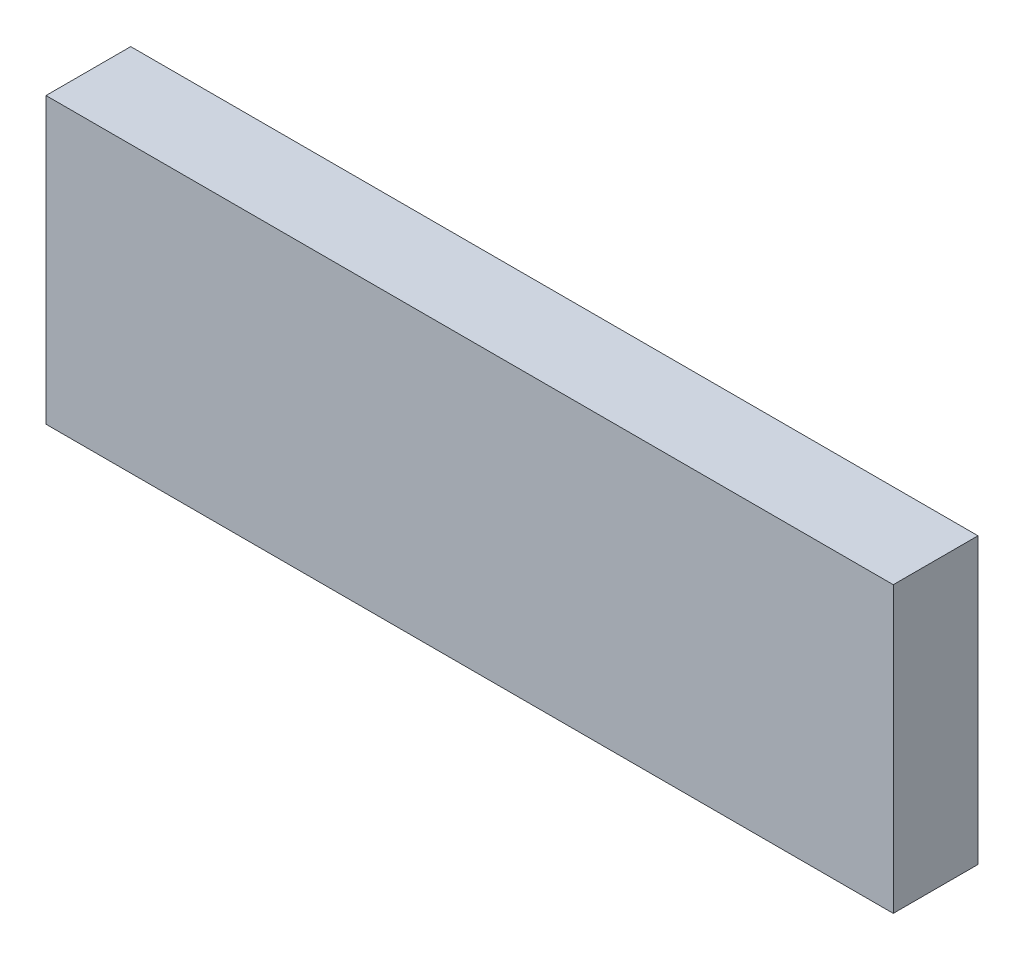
ISO-10303-21;
HEADER;
FILE_DESCRIPTION(('STEP AP214'),'2;1');
FILE_NAME('part.step','',(''),(''),'','','');
FILE_SCHEMA(('AUTOMOTIVE_DESIGN { 1 0 10303 214 1 1 1 1 }'));
ENDSEC;
DATA;
#1=APPLICATION_CONTEXT('core data for automotive mechanical design processes');
#2=APPLICATION_PROTOCOL_DEFINITION('international standard','automotive_design',2000,#1);
#3=PRODUCT_CONTEXT('',#1,'mechanical');
#4=PRODUCT('Part','Part','',(#3));
#5=PRODUCT_RELATED_PRODUCT_CATEGORY('part','',(#4));
#6=PRODUCT_DEFINITION_FORMATION('','',#4);
#7=PRODUCT_DEFINITION_CONTEXT('part definition',#1,'design');
#8=PRODUCT_DEFINITION('design','',#6,#7);
#9=PRODUCT_DEFINITION_SHAPE('','',#8);
#10=(LENGTH_UNIT() NAMED_UNIT(*) SI_UNIT(.MILLI.,.METRE.));
#11=(NAMED_UNIT(*) PLANE_ANGLE_UNIT() SI_UNIT($,.RADIAN.));
#12=(NAMED_UNIT(*) SI_UNIT($,.STERADIAN.) SOLID_ANGLE_UNIT());
#13=UNCERTAINTY_MEASURE_WITH_UNIT(LENGTH_MEASURE(1.E-05),#10,'distance_accuracy_value','');
#14=(GEOMETRIC_REPRESENTATION_CONTEXT(3) GLOBAL_UNCERTAINTY_ASSIGNED_CONTEXT((#13)) GLOBAL_UNIT_ASSIGNED_CONTEXT((#10,
#11,#12)) REPRESENTATION_CONTEXT('',''));
#15=CARTESIAN_POINT('',(0.,0.,0.));
#16=DIRECTION('',(0.,0.,1.));
#17=DIRECTION('',(1.,0.,0.));
#18=AXIS2_PLACEMENT_3D('',#15,#16,#17);
#19=CARTESIAN_POINT('',(0.,0.,3.175));
#20=DIRECTION('',(1.,0.,0.));
#21=DIRECTION('',(0.,0.,-1.));
#22=AXIS2_PLACEMENT_3D('',#19,#20,#21);
#23=PLANE('',#22);
#24=DIRECTION('',(0.,-1.,0.));
#25=VECTOR('',#24,1.);
#26=CARTESIAN_POINT('',(0.,0.,0.));
#27=LINE('',#26,#25);
#28=CARTESIAN_POINT('',(0.,10.668,0.));
#29=VERTEX_POINT('',#28);
#30=CARTESIAN_POINT('',(0.,0.,0.));
#31=VERTEX_POINT('',#30);
#32=EDGE_CURVE('E75',#29,#31,#27,.T.);
#33=ORIENTED_EDGE('',*,*,#32,.T.);
#34=DIRECTION('',(0.,0.,-1.));
#35=VECTOR('',#34,1.);
#36=CARTESIAN_POINT('',(0.,0.,3.175));
#37=LINE('',#36,#35);
#38=CARTESIAN_POINT('',(0.,0.,3.175));
#39=VERTEX_POINT('',#38);
#40=EDGE_CURVE('E11',#39,#31,#37,.T.);
#41=ORIENTED_EDGE('',*,*,#40,.F.);
#42=DIRECTION('',(0.,-1.,0.));
#43=VECTOR('',#42,1.);
#44=CARTESIAN_POINT('',(0.,0.,3.175));
#45=LINE('',#44,#43);
#46=CARTESIAN_POINT('',(0.,10.668,3.175));
#47=VERTEX_POINT('',#46);
#48=EDGE_CURVE('E93',#47,#39,#45,.T.);
#49=ORIENTED_EDGE('',*,*,#48,.F.);
#50=DIRECTION('',(0.,0.,-1.));
#51=VECTOR('',#50,1.);
#52=CARTESIAN_POINT('',(0.,10.668,3.175));
#53=LINE('',#52,#51);
#54=EDGE_CURVE('E87',#47,#29,#53,.T.);
#55=ORIENTED_EDGE('',*,*,#54,.T.);
#56=EDGE_LOOP('',(#33,#41,#49,#55));
#57=FACE_BOUND('',#56,.T.);
#58=ADVANCED_FACE('F31',(#57),#23,.F.);
#59=CARTESIAN_POINT('',(0.,0.,3.175));
#60=DIRECTION('',(0.,1.,0.));
#61=DIRECTION('',(0.,0.,1.));
#62=AXIS2_PLACEMENT_3D('',#59,#60,#61);
#63=PLANE('',#62);
#64=DIRECTION('',(1.,0.,0.));
#65=VECTOR('',#64,1.);
#66=CARTESIAN_POINT('',(0.,0.,0.));
#67=LINE('',#66,#65);
#68=CARTESIAN_POINT('',(31.75,0.,0.));
#69=VERTEX_POINT('',#68);
#70=EDGE_CURVE('E71',#31,#69,#67,.T.);
#71=ORIENTED_EDGE('',*,*,#70,.T.);
#72=DIRECTION('',(0.,0.,-1.));
#73=VECTOR('',#72,1.);
#74=CARTESIAN_POINT('',(31.75,0.,3.175));
#75=LINE('',#74,#73);
#76=CARTESIAN_POINT('',(31.75,0.,3.175));
#77=VERTEX_POINT('',#76);
#78=EDGE_CURVE('E38',#77,#69,#75,.T.);
#79=ORIENTED_EDGE('',*,*,#78,.F.);
#80=DIRECTION('',(1.,0.,0.));
#81=VECTOR('',#80,1.);
#82=CARTESIAN_POINT('',(0.,0.,3.175));
#83=LINE('',#82,#81);
#84=EDGE_CURVE('E83',#39,#77,#83,.T.);
#85=ORIENTED_EDGE('',*,*,#84,.F.);
#86=ORIENTED_EDGE('',*,*,#40,.T.);
#87=EDGE_LOOP('',(#71,#79,#85,#86));
#88=FACE_BOUND('',#87,.T.);
#89=ADVANCED_FACE('F82',(#88),#63,.F.);
#90=CARTESIAN_POINT('',(31.75,0.,3.175));
#91=DIRECTION('',(-1.,0.,0.));
#92=DIRECTION('',(0.,0.,1.));
#93=AXIS2_PLACEMENT_3D('',#90,#91,#92);
#94=PLANE('',#93);
#95=DIRECTION('',(0.,1.,0.));
#96=VECTOR('',#95,1.);
#97=CARTESIAN_POINT('',(31.75,0.,0.));
#98=LINE('',#97,#96);
#99=CARTESIAN_POINT('',(31.75,10.668,0.));
#100=VERTEX_POINT('',#99);
#101=EDGE_CURVE('E76',#69,#100,#98,.T.);
#102=ORIENTED_EDGE('',*,*,#101,.T.);
#103=DIRECTION('',(0.,0.,-1.));
#104=VECTOR('',#103,1.);
#105=CARTESIAN_POINT('',(31.75,10.668,3.175));
#106=LINE('',#105,#104);
#107=CARTESIAN_POINT('',(31.75,10.668,3.175));
#108=VERTEX_POINT('',#107);
#109=EDGE_CURVE('E99',#108,#100,#106,.T.);
#110=ORIENTED_EDGE('',*,*,#109,.F.);
#111=DIRECTION('',(0.,1.,0.));
#112=VECTOR('',#111,1.);
#113=CARTESIAN_POINT('',(31.75,0.,3.175));
#114=LINE('',#113,#112);
#115=EDGE_CURVE('E50',#77,#108,#114,.T.);
#116=ORIENTED_EDGE('',*,*,#115,.F.);
#117=ORIENTED_EDGE('',*,*,#78,.T.);
#118=EDGE_LOOP('',(#102,#110,#116,#117));
#119=FACE_BOUND('',#118,.T.);
#120=ADVANCED_FACE('F102',(#119),#94,.F.);
#121=CARTESIAN_POINT('',(0.,10.668,3.175));
#122=DIRECTION('',(0.,-1.,0.));
#123=DIRECTION('',(0.,0.,-1.));
#124=AXIS2_PLACEMENT_3D('',#121,#122,#123);
#125=PLANE('',#124);
#126=DIRECTION('',(-1.,0.,0.));
#127=VECTOR('',#126,1.);
#128=CARTESIAN_POINT('',(0.,10.668,0.));
#129=LINE('',#128,#127);
#130=EDGE_CURVE('E91',#100,#29,#129,.T.);
#131=ORIENTED_EDGE('',*,*,#130,.T.);
#132=ORIENTED_EDGE('',*,*,#54,.F.);
#133=DIRECTION('',(-1.,0.,0.));
#134=VECTOR('',#133,1.);
#135=CARTESIAN_POINT('',(0.,10.668,3.175));
#136=LINE('',#135,#134);
#137=EDGE_CURVE('E45',#108,#47,#136,.T.);
#138=ORIENTED_EDGE('',*,*,#137,.F.);
#139=ORIENTED_EDGE('',*,*,#109,.T.);
#140=EDGE_LOOP('',(#131,#132,#138,#139));
#141=FACE_BOUND('',#140,.T.);
#142=ADVANCED_FACE('F104',(#141),#125,.F.);
#143=CARTESIAN_POINT('',(0.,10.668,3.175));
#144=DIRECTION('',(0.,0.,-1.));
#145=DIRECTION('',(-1.,0.,0.));
#146=AXIS2_PLACEMENT_3D('',#143,#144,#145);
#147=PLANE('',#146);
#148=ORIENTED_EDGE('',*,*,#48,.T.);
#149=ORIENTED_EDGE('',*,*,#84,.T.);
#150=ORIENTED_EDGE('',*,*,#115,.T.);
#151=ORIENTED_EDGE('',*,*,#137,.T.);
#152=EDGE_LOOP('',(#148,#149,#150,#151));
#153=FACE_BOUND('',#152,.T.);
#154=ADVANCED_FACE('F105',(#153),#147,.F.);
#155=CARTESIAN_POINT('',(0.,10.668,0.));
#156=DIRECTION('',(0.,0.,-1.));
#157=DIRECTION('',(-1.,0.,0.));
#158=AXIS2_PLACEMENT_3D('',#155,#156,#157);
#159=PLANE('',#158);
#160=ORIENTED_EDGE('',*,*,#32,.F.);
#161=ORIENTED_EDGE('',*,*,#130,.F.);
#162=ORIENTED_EDGE('',*,*,#101,.F.);
#163=ORIENTED_EDGE('',*,*,#70,.F.);
#164=EDGE_LOOP('',(#160,#161,#162,#163));
#165=FACE_BOUND('',#164,.T.);
#166=ADVANCED_FACE('F72',(#165),#159,.T.);
#167=CLOSED_SHELL('',(#58,#89,#120,#142,#154,#166));
#168=MANIFOLD_SOLID_BREP('B2',#167);
#169=ADVANCED_BREP_SHAPE_REPRESENTATION('',(#18,#168),#14);
#170=SHAPE_DEFINITION_REPRESENTATION(#9,#169);
ENDSEC;
END-ISO-10303-21;
